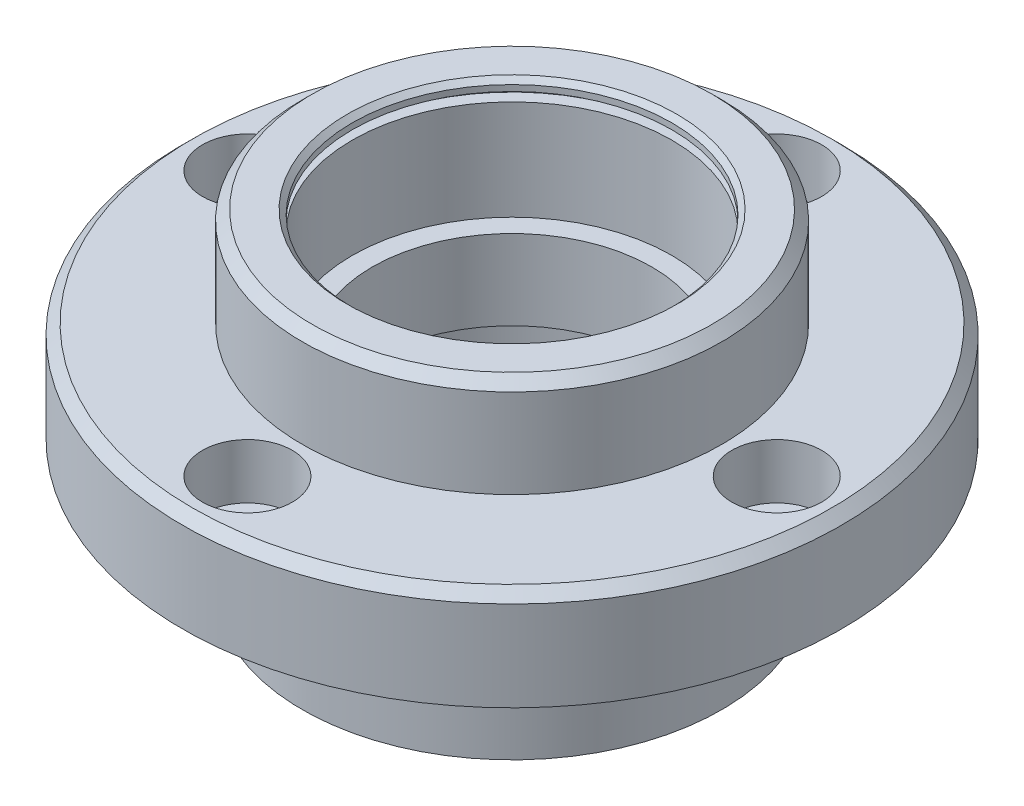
ISO-10303-21;
HEADER;
FILE_DESCRIPTION(('STEP AP214'),'2;1');
FILE_NAME('part.step','',(''),(''),'','','');
FILE_SCHEMA(('AUTOMOTIVE_DESIGN { 1 0 10303 214 1 1 1 1 }'));
ENDSEC;
DATA;
#1=APPLICATION_CONTEXT('core data for automotive mechanical design processes');
#2=APPLICATION_PROTOCOL_DEFINITION('international standard','automotive_design',2000,#1);
#3=PRODUCT_CONTEXT('',#1,'mechanical');
#4=PRODUCT('Part','Part','',(#3));
#5=PRODUCT_RELATED_PRODUCT_CATEGORY('part','',(#4));
#6=PRODUCT_DEFINITION_FORMATION('','',#4);
#7=PRODUCT_DEFINITION_CONTEXT('part definition',#1,'design');
#8=PRODUCT_DEFINITION('design','',#6,#7);
#9=PRODUCT_DEFINITION_SHAPE('','',#8);
#10=(LENGTH_UNIT() NAMED_UNIT(*) SI_UNIT(.MILLI.,.METRE.));
#11=(NAMED_UNIT(*) PLANE_ANGLE_UNIT() SI_UNIT($,.RADIAN.));
#12=(NAMED_UNIT(*) SI_UNIT($,.STERADIAN.) SOLID_ANGLE_UNIT());
#13=UNCERTAINTY_MEASURE_WITH_UNIT(LENGTH_MEASURE(1.E-05),#10,'distance_accuracy_value','');
#14=(GEOMETRIC_REPRESENTATION_CONTEXT(3) GLOBAL_UNCERTAINTY_ASSIGNED_CONTEXT((#13)) GLOBAL_UNIT_ASSIGNED_CONTEXT((#10,
#11,#12)) REPRESENTATION_CONTEXT('',''));
#15=CARTESIAN_POINT('',(0.,0.,0.));
#16=DIRECTION('',(0.,0.,1.));
#17=DIRECTION('',(1.,0.,0.));
#18=AXIS2_PLACEMENT_3D('',#15,#16,#17);
#19=CARTESIAN_POINT('',(-33.,13.,0.));
#20=DIRECTION('',(0.,1.,0.));
#21=DIRECTION('',(0.,0.,1.));
#22=AXIS2_PLACEMENT_3D('',#19,#20,#21);
#23=PLANE('',#22);
#24=CARTESIAN_POINT('',(-2.74327452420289E-13,13.,26.5));
#25=DIRECTION('',(0.,1.,0.));
#26=DIRECTION('',(0.,0.,1.));
#27=AXIS2_PLACEMENT_3D('',#24,#25,#26);
#28=CIRCLE('',#27,2.75);
#29=CARTESIAN_POINT('',(-2.74327452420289E-13,13.,29.25));
#30=VERTEX_POINT('',#29);
#31=EDGE_CURVE('E64',#30,#30,#28,.T.);
#32=ORIENTED_EDGE('',*,*,#31,.T.);
#33=EDGE_LOOP('',(#32));
#34=FACE_BOUND('',#33,.T.);
#35=CARTESIAN_POINT('',(26.5,13.,0.));
#36=DIRECTION('',(0.,1.,0.));
#37=DIRECTION('',(0.,0.,1.));
#38=AXIS2_PLACEMENT_3D('',#35,#36,#37);
#39=CIRCLE('',#38,2.75);
#40=CARTESIAN_POINT('',(26.5,13.,2.74999999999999));
#41=VERTEX_POINT('',#40);
#42=EDGE_CURVE('E69',#41,#41,#39,.T.);
#43=ORIENTED_EDGE('',*,*,#42,.T.);
#44=EDGE_LOOP('',(#43));
#45=FACE_BOUND('',#44,.T.);
#46=CARTESIAN_POINT('',(0.,13.,-26.5));
#47=DIRECTION('',(0.,1.,0.));
#48=DIRECTION('',(0.,0.,1.));
#49=AXIS2_PLACEMENT_3D('',#46,#47,#48);
#50=CIRCLE('',#49,2.75);
#51=CARTESIAN_POINT('',(0.,13.,-23.75));
#52=VERTEX_POINT('',#51);
#53=EDGE_CURVE('E74',#52,#52,#50,.T.);
#54=ORIENTED_EDGE('',*,*,#53,.T.);
#55=EDGE_LOOP('',(#54));
#56=FACE_BOUND('',#55,.T.);
#57=CARTESIAN_POINT('',(-26.5,13.,0.));
#58=DIRECTION('',(0.,1.,0.));
#59=DIRECTION('',(0.,0.,1.));
#60=AXIS2_PLACEMENT_3D('',#57,#58,#59);
#61=CIRCLE('',#60,2.75);
#62=CARTESIAN_POINT('',(-26.5,13.,2.75));
#63=VERTEX_POINT('',#62);
#64=EDGE_CURVE('E79',#63,#63,#61,.T.);
#65=ORIENTED_EDGE('',*,*,#64,.T.);
#66=EDGE_LOOP('',(#65));
#67=FACE_BOUND('',#66,.T.);
#68=CARTESIAN_POINT('',(0.,13.,0.));
#69=DIRECTION('',(0.,-1.,0.));
#70=DIRECTION('',(0.,0.,-1.));
#71=AXIS2_PLACEMENT_3D('',#68,#69,#70);
#72=CIRCLE('',#71,21.);
#73=CARTESIAN_POINT('',(0.,13.,-21.));
#74=VERTEX_POINT('',#73);
#75=EDGE_CURVE('E82',#74,#74,#72,.T.);
#76=ORIENTED_EDGE('',*,*,#75,.F.);
#77=EDGE_LOOP('',(#76));
#78=FACE_BOUND('',#77,.T.);
#79=CARTESIAN_POINT('',(0.,13.,0.));
#80=DIRECTION('',(0.,-1.,0.));
#81=DIRECTION('',(0.,0.,-1.));
#82=AXIS2_PLACEMENT_3D('',#79,#80,#81);
#83=CIRCLE('',#82,33.);
#84=CARTESIAN_POINT('',(0.,13.,-33.));
#85=VERTEX_POINT('',#84);
#86=EDGE_CURVE('E63',#85,#85,#83,.T.);
#87=ORIENTED_EDGE('',*,*,#86,.T.);
#88=EDGE_LOOP('',(#87));
#89=FACE_BOUND('',#88,.T.);
#90=ADVANCED_FACE('F31',(#34,#45,#56,#67,#78,#89),#23,.F.);
#91=CARTESIAN_POINT('',(0.,0.,0.));
#92=DIRECTION('',(0.,-1.,0.));
#93=DIRECTION('',(0.,0.,-1.));
#94=AXIS2_PLACEMENT_3D('',#91,#92,#93);
#95=CYLINDRICAL_SURFACE('',#94,33.);
#96=CARTESIAN_POINT('',(0.,22.,0.));
#97=DIRECTION('',(0.,-1.,0.));
#98=DIRECTION('',(0.,0.,-1.));
#99=AXIS2_PLACEMENT_3D('',#96,#97,#98);
#100=CIRCLE('',#99,33.);
#101=CARTESIAN_POINT('',(0.,22.,-33.));
#102=VERTEX_POINT('',#101);
#103=EDGE_CURVE('E54',#102,#102,#100,.T.);
#104=ORIENTED_EDGE('',*,*,#103,.T.);
#105=EDGE_LOOP('',(#104));
#106=FACE_BOUND('',#105,.T.);
#107=ORIENTED_EDGE('',*,*,#86,.F.);
#108=EDGE_LOOP('',(#107));
#109=FACE_BOUND('',#108,.T.);
#110=ADVANCED_FACE('F166',(#106,#109),#95,.T.);
#111=CARTESIAN_POINT('',(-21.,23.,0.));
#112=DIRECTION('',(0.,-1.,0.));
#113=DIRECTION('',(0.,0.,-1.));
#114=AXIS2_PLACEMENT_3D('',#111,#112,#113);
#115=PLANE('',#114);
#116=CARTESIAN_POINT('',(0.,23.,0.));
#117=DIRECTION('',(0.,-1.,0.));
#118=DIRECTION('',(0.,0.,-1.));
#119=AXIS2_PLACEMENT_3D('',#116,#117,#118);
#120=CIRCLE('',#119,32.);
#121=CARTESIAN_POINT('',(0.,23.,-32.));
#122=VERTEX_POINT('',#121);
#123=EDGE_CURVE('E51',#122,#122,#120,.F.);
#124=ORIENTED_EDGE('',*,*,#123,.T.);
#125=EDGE_LOOP('',(#124));
#126=FACE_BOUND('',#125,.T.);
#127=CARTESIAN_POINT('',(-2.74327452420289E-13,23.,26.5));
#128=DIRECTION('',(0.,1.,0.));
#129=DIRECTION('',(0.,0.,1.));
#130=AXIS2_PLACEMENT_3D('',#127,#128,#129);
#131=CIRCLE('',#130,4.5);
#132=CARTESIAN_POINT('',(-2.74327452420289E-13,23.,31.));
#133=VERTEX_POINT('',#132);
#134=EDGE_CURVE('E156',#133,#133,#131,.T.);
#135=ORIENTED_EDGE('',*,*,#134,.F.);
#136=EDGE_LOOP('',(#135));
#137=FACE_BOUND('',#136,.T.);
#138=CARTESIAN_POINT('',(26.5,23.,0.));
#139=DIRECTION('',(0.,1.,0.));
#140=DIRECTION('',(0.,0.,1.));
#141=AXIS2_PLACEMENT_3D('',#138,#139,#140);
#142=CIRCLE('',#141,4.5);
#143=CARTESIAN_POINT('',(26.5,23.,4.5));
#144=VERTEX_POINT('',#143);
#145=EDGE_CURVE('E67',#144,#144,#142,.T.);
#146=ORIENTED_EDGE('',*,*,#145,.F.);
#147=EDGE_LOOP('',(#146));
#148=FACE_BOUND('',#147,.T.);
#149=CARTESIAN_POINT('',(0.,23.,-26.5));
#150=DIRECTION('',(0.,1.,0.));
#151=DIRECTION('',(0.,0.,1.));
#152=AXIS2_PLACEMENT_3D('',#149,#150,#151);
#153=CIRCLE('',#152,4.5);
#154=CARTESIAN_POINT('',(0.,23.,-22.));
#155=VERTEX_POINT('',#154);
#156=EDGE_CURVE('E72',#155,#155,#153,.T.);
#157=ORIENTED_EDGE('',*,*,#156,.F.);
#158=EDGE_LOOP('',(#157));
#159=FACE_BOUND('',#158,.T.);
#160=CARTESIAN_POINT('',(-26.5,23.,0.));
#161=DIRECTION('',(0.,1.,0.));
#162=DIRECTION('',(0.,0.,1.));
#163=AXIS2_PLACEMENT_3D('',#160,#161,#162);
#164=CIRCLE('',#163,4.5);
#165=CARTESIAN_POINT('',(-26.5,23.,4.5));
#166=VERTEX_POINT('',#165);
#167=EDGE_CURVE('E77',#166,#166,#164,.T.);
#168=ORIENTED_EDGE('',*,*,#167,.F.);
#169=EDGE_LOOP('',(#168));
#170=FACE_BOUND('',#169,.T.);
#171=CARTESIAN_POINT('',(0.,23.,0.));
#172=DIRECTION('',(0.,-1.,0.));
#173=DIRECTION('',(0.,0.,-1.));
#174=AXIS2_PLACEMENT_3D('',#171,#172,#173);
#175=CIRCLE('',#174,21.);
#176=CARTESIAN_POINT('',(0.,23.,-21.));
#177=VERTEX_POINT('',#176);
#178=EDGE_CURVE('E86',#177,#177,#175,.T.);
#179=ORIENTED_EDGE('',*,*,#178,.T.);
#180=EDGE_LOOP('',(#179));
#181=FACE_BOUND('',#180,.T.);
#182=ADVANCED_FACE('F162',(#126,#137,#148,#159,#170,#181),#115,.F.);
#183=CARTESIAN_POINT('',(0.,0.,0.));
#184=DIRECTION('',(0.,-1.,0.));
#185=DIRECTION('',(0.,0.,-1.));
#186=AXIS2_PLACEMENT_3D('',#183,#184,#185);
#187=CYLINDRICAL_SURFACE('',#186,21.);
#188=CARTESIAN_POINT('',(0.,31.9,0.));
#189=DIRECTION('',(0.,-1.,0.));
#190=DIRECTION('',(0.,0.,-1.));
#191=AXIS2_PLACEMENT_3D('',#188,#189,#190);
#192=CIRCLE('',#191,21.);
#193=CARTESIAN_POINT('',(0.,31.9,-21.));
#194=VERTEX_POINT('',#193);
#195=EDGE_CURVE('E60',#194,#194,#192,.T.);
#196=ORIENTED_EDGE('',*,*,#195,.T.);
#197=EDGE_LOOP('',(#196));
#198=FACE_BOUND('',#197,.T.);
#199=ORIENTED_EDGE('',*,*,#178,.F.);
#200=EDGE_LOOP('',(#199));
#201=FACE_BOUND('',#200,.T.);
#202=ADVANCED_FACE('F165',(#198,#201),#187,.T.);
#203=CARTESIAN_POINT('',(-16.,32.9,0.));
#204=DIRECTION('',(0.,-1.,0.));
#205=DIRECTION('',(0.,0.,-1.));
#206=AXIS2_PLACEMENT_3D('',#203,#204,#205);
#207=PLANE('',#206);
#208=CARTESIAN_POINT('',(0.,32.9,0.));
#209=DIRECTION('',(0.,-1.,0.));
#210=DIRECTION('',(0.,0.,-1.));
#211=AXIS2_PLACEMENT_3D('',#208,#209,#210);
#212=CIRCLE('',#211,16.5);
#213=CARTESIAN_POINT('',(0.,32.9,-16.5));
#214=VERTEX_POINT('',#213);
#215=EDGE_CURVE('E38',#214,#214,#212,.T.);
#216=ORIENTED_EDGE('',*,*,#215,.T.);
#217=EDGE_LOOP('',(#216));
#218=FACE_BOUND('',#217,.T.);
#219=CARTESIAN_POINT('',(0.,32.9,0.));
#220=DIRECTION('',(0.,-1.,0.));
#221=DIRECTION('',(0.,0.,-1.));
#222=AXIS2_PLACEMENT_3D('',#219,#220,#221);
#223=CIRCLE('',#222,20.);
#224=CARTESIAN_POINT('',(0.,32.9,-20.));
#225=VERTEX_POINT('',#224);
#226=EDGE_CURVE('E57',#225,#225,#223,.F.);
#227=ORIENTED_EDGE('',*,*,#226,.T.);
#228=EDGE_LOOP('',(#227));
#229=FACE_BOUND('',#228,.T.);
#230=ADVANCED_FACE('F178',(#218,#229),#207,.F.);
#231=CARTESIAN_POINT('',(0.,0.,0.));
#232=DIRECTION('',(0.,-1.,0.));
#233=DIRECTION('',(0.,0.,-1.));
#234=AXIS2_PLACEMENT_3D('',#231,#232,#233);
#235=CYLINDRICAL_SURFACE('',#234,16.);
#236=CARTESIAN_POINT('',(0.,32.4,0.));
#237=DIRECTION('',(0.,-1.,0.));
#238=DIRECTION('',(0.,0.,-1.));
#239=AXIS2_PLACEMENT_3D('',#236,#237,#238);
#240=CIRCLE('',#239,16.);
#241=CARTESIAN_POINT('',(0.,32.4,-16.));
#242=VERTEX_POINT('',#241);
#243=EDGE_CURVE('E10',#242,#242,#240,.F.);
#244=ORIENTED_EDGE('',*,*,#243,.T.);
#245=EDGE_LOOP('',(#244));
#246=FACE_BOUND('',#245,.T.);
#247=CARTESIAN_POINT('',(0.,31.8,0.));
#248=DIRECTION('',(0.,-1.,0.));
#249=DIRECTION('',(0.,0.,-1.));
#250=AXIS2_PLACEMENT_3D('',#247,#248,#249);
#251=CIRCLE('',#250,16.);
#252=CARTESIAN_POINT('',(0.,31.8,-16.));
#253=VERTEX_POINT('',#252);
#254=EDGE_CURVE('E89',#253,#253,#251,.T.);
#255=ORIENTED_EDGE('',*,*,#254,.T.);
#256=EDGE_LOOP('',(#255));
#257=FACE_BOUND('',#256,.T.);
#258=ADVANCED_FACE('F184',(#246,#257),#235,.F.);
#259=CARTESIAN_POINT('',(-17.2,31.8,0.));
#260=DIRECTION('',(0.,1.,0.));
#261=DIRECTION('',(0.,0.,1.));
#262=AXIS2_PLACEMENT_3D('',#259,#260,#261);
#263=PLANE('',#262);
#264=ORIENTED_EDGE('',*,*,#254,.F.);
#265=EDGE_LOOP('',(#264));
#266=FACE_BOUND('',#265,.T.);
#267=CARTESIAN_POINT('',(0.,31.8,0.));
#268=DIRECTION('',(0.,-1.,0.));
#269=DIRECTION('',(0.,0.,-1.));
#270=AXIS2_PLACEMENT_3D('',#267,#268,#269);
#271=CIRCLE('',#270,17.2);
#272=CARTESIAN_POINT('',(0.,31.8,-17.2));
#273=VERTEX_POINT('',#272);
#274=EDGE_CURVE('E92',#273,#273,#271,.T.);
#275=ORIENTED_EDGE('',*,*,#274,.T.);
#276=EDGE_LOOP('',(#275));
#277=FACE_BOUND('',#276,.T.);
#278=ADVANCED_FACE('F265',(#266,#277),#263,.F.);
#279=CARTESIAN_POINT('',(0.,0.,0.));
#280=DIRECTION('',(0.,-1.,0.));
#281=DIRECTION('',(0.,0.,-1.));
#282=AXIS2_PLACEMENT_3D('',#279,#280,#281);
#283=CYLINDRICAL_SURFACE('',#282,17.2);
#284=ORIENTED_EDGE('',*,*,#274,.F.);
#285=EDGE_LOOP('',(#284));
#286=FACE_BOUND('',#285,.T.);
#287=CARTESIAN_POINT('',(0.,30.9,0.));
#288=DIRECTION('',(0.,-1.,0.));
#289=DIRECTION('',(0.,0.,-1.));
#290=AXIS2_PLACEMENT_3D('',#287,#288,#289);
#291=CIRCLE('',#290,17.2);
#292=CARTESIAN_POINT('',(0.,30.9,-17.2));
#293=VERTEX_POINT('',#292);
#294=EDGE_CURVE('E95',#293,#293,#291,.T.);
#295=ORIENTED_EDGE('',*,*,#294,.T.);
#296=EDGE_LOOP('',(#295));
#297=FACE_BOUND('',#296,.T.);
#298=ADVANCED_FACE('F261',(#286,#297),#283,.F.);
#299=CARTESIAN_POINT('',(-16.,30.9,0.));
#300=DIRECTION('',(0.,-1.,0.));
#301=DIRECTION('',(0.,0.,-1.));
#302=AXIS2_PLACEMENT_3D('',#299,#300,#301);
#303=PLANE('',#302);
#304=ORIENTED_EDGE('',*,*,#294,.F.);
#305=EDGE_LOOP('',(#304));
#306=FACE_BOUND('',#305,.T.);
#307=CARTESIAN_POINT('',(0.,30.9,0.));
#308=DIRECTION('',(0.,-1.,0.));
#309=DIRECTION('',(0.,0.,-1.));
#310=AXIS2_PLACEMENT_3D('',#307,#308,#309);
#311=CIRCLE('',#310,16.);
#312=CARTESIAN_POINT('',(0.,30.9,-16.));
#313=VERTEX_POINT('',#312);
#314=EDGE_CURVE('E98',#313,#313,#311,.T.);
#315=ORIENTED_EDGE('',*,*,#314,.T.);
#316=EDGE_LOOP('',(#315));
#317=FACE_BOUND('',#316,.T.);
#318=ADVANCED_FACE('F257',(#306,#317),#303,.F.);
#319=CARTESIAN_POINT('',(0.,0.,0.));
#320=DIRECTION('',(0.,-1.,0.));
#321=DIRECTION('',(0.,0.,-1.));
#322=AXIS2_PLACEMENT_3D('',#319,#320,#321);
#323=CYLINDRICAL_SURFACE('',#322,16.);
#324=ORIENTED_EDGE('',*,*,#314,.F.);
#325=EDGE_LOOP('',(#324));
#326=FACE_BOUND('',#325,.T.);
#327=CARTESIAN_POINT('',(0.,20.9,0.));
#328=DIRECTION('',(0.,-1.,0.));
#329=DIRECTION('',(0.,0.,-1.));
#330=AXIS2_PLACEMENT_3D('',#327,#328,#329);
#331=CIRCLE('',#330,16.);
#332=CARTESIAN_POINT('',(0.,20.9,-16.));
#333=VERTEX_POINT('',#332);
#334=EDGE_CURVE('E101',#333,#333,#331,.T.);
#335=ORIENTED_EDGE('',*,*,#334,.T.);
#336=EDGE_LOOP('',(#335));
#337=FACE_BOUND('',#336,.T.);
#338=ADVANCED_FACE('F253',(#326,#337),#323,.F.);
#339=CARTESIAN_POINT('',(-14.,20.9,0.));
#340=DIRECTION('',(0.,-1.,0.));
#341=DIRECTION('',(0.,0.,-1.));
#342=AXIS2_PLACEMENT_3D('',#339,#340,#341);
#343=PLANE('',#342);
#344=ORIENTED_EDGE('',*,*,#334,.F.);
#345=EDGE_LOOP('',(#344));
#346=FACE_BOUND('',#345,.T.);
#347=CARTESIAN_POINT('',(0.,20.9,0.));
#348=DIRECTION('',(0.,-1.,0.));
#349=DIRECTION('',(0.,0.,-1.));
#350=AXIS2_PLACEMENT_3D('',#347,#348,#349);
#351=CIRCLE('',#350,14.);
#352=CARTESIAN_POINT('',(0.,20.9,-14.));
#353=VERTEX_POINT('',#352);
#354=EDGE_CURVE('E104',#353,#353,#351,.T.);
#355=ORIENTED_EDGE('',*,*,#354,.T.);
#356=EDGE_LOOP('',(#355));
#357=FACE_BOUND('',#356,.T.);
#358=ADVANCED_FACE('F249',(#346,#357),#343,.F.);
#359=CARTESIAN_POINT('',(0.,0.,0.));
#360=DIRECTION('',(0.,-1.,0.));
#361=DIRECTION('',(0.,0.,-1.));
#362=AXIS2_PLACEMENT_3D('',#359,#360,#361);
#363=CYLINDRICAL_SURFACE('',#362,14.);
#364=ORIENTED_EDGE('',*,*,#354,.F.);
#365=EDGE_LOOP('',(#364));
#366=FACE_BOUND('',#365,.T.);
#367=CARTESIAN_POINT('',(0.,12.9,0.));
#368=DIRECTION('',(0.,-1.,0.));
#369=DIRECTION('',(0.,0.,-1.));
#370=AXIS2_PLACEMENT_3D('',#367,#368,#369);
#371=CIRCLE('',#370,14.);
#372=CARTESIAN_POINT('',(0.,12.9,-14.));
#373=VERTEX_POINT('',#372);
#374=EDGE_CURVE('E107',#373,#373,#371,.T.);
#375=ORIENTED_EDGE('',*,*,#374,.T.);
#376=EDGE_LOOP('',(#375));
#377=FACE_BOUND('',#376,.T.);
#378=ADVANCED_FACE('F245',(#366,#377),#363,.F.);
#379=CARTESIAN_POINT('',(-16.,12.9,0.));
#380=DIRECTION('',(0.,1.,0.));
#381=DIRECTION('',(0.,0.,1.));
#382=AXIS2_PLACEMENT_3D('',#379,#380,#381);
#383=PLANE('',#382);
#384=ORIENTED_EDGE('',*,*,#374,.F.);
#385=EDGE_LOOP('',(#384));
#386=FACE_BOUND('',#385,.T.);
#387=CARTESIAN_POINT('',(0.,12.9,0.));
#388=DIRECTION('',(0.,-1.,0.));
#389=DIRECTION('',(0.,0.,-1.));
#390=AXIS2_PLACEMENT_3D('',#387,#388,#389);
#391=CIRCLE('',#390,16.);
#392=CARTESIAN_POINT('',(0.,12.9,-16.));
#393=VERTEX_POINT('',#392);
#394=EDGE_CURVE('E110',#393,#393,#391,.T.);
#395=ORIENTED_EDGE('',*,*,#394,.T.);
#396=EDGE_LOOP('',(#395));
#397=FACE_BOUND('',#396,.T.);
#398=ADVANCED_FACE('F241',(#386,#397),#383,.F.);
#399=CARTESIAN_POINT('',(0.,0.,0.));
#400=DIRECTION('',(0.,-1.,0.));
#401=DIRECTION('',(0.,0.,-1.));
#402=AXIS2_PLACEMENT_3D('',#399,#400,#401);
#403=CYLINDRICAL_SURFACE('',#402,16.);
#404=ORIENTED_EDGE('',*,*,#394,.F.);
#405=EDGE_LOOP('',(#404));
#406=FACE_BOUND('',#405,.T.);
#407=CARTESIAN_POINT('',(0.,2.9,0.));
#408=DIRECTION('',(0.,-1.,0.));
#409=DIRECTION('',(0.,0.,-1.));
#410=AXIS2_PLACEMENT_3D('',#407,#408,#409);
#411=CIRCLE('',#410,16.);
#412=CARTESIAN_POINT('',(0.,2.9,-16.));
#413=VERTEX_POINT('',#412);
#414=EDGE_CURVE('E113',#413,#413,#411,.T.);
#415=ORIENTED_EDGE('',*,*,#414,.T.);
#416=EDGE_LOOP('',(#415));
#417=FACE_BOUND('',#416,.T.);
#418=ADVANCED_FACE('F237',(#406,#417),#403,.F.);
#419=CARTESIAN_POINT('',(-17.2,2.9,0.));
#420=DIRECTION('',(0.,1.,0.));
#421=DIRECTION('',(0.,0.,1.));
#422=AXIS2_PLACEMENT_3D('',#419,#420,#421);
#423=PLANE('',#422);
#424=ORIENTED_EDGE('',*,*,#414,.F.);
#425=EDGE_LOOP('',(#424));
#426=FACE_BOUND('',#425,.T.);
#427=CARTESIAN_POINT('',(0.,2.9,0.));
#428=DIRECTION('',(0.,-1.,0.));
#429=DIRECTION('',(0.,0.,-1.));
#430=AXIS2_PLACEMENT_3D('',#427,#428,#429);
#431=CIRCLE('',#430,17.2);
#432=CARTESIAN_POINT('',(0.,2.9,-17.2));
#433=VERTEX_POINT('',#432);
#434=EDGE_CURVE('E116',#433,#433,#431,.T.);
#435=ORIENTED_EDGE('',*,*,#434,.T.);
#436=EDGE_LOOP('',(#435));
#437=FACE_BOUND('',#436,.T.);
#438=ADVANCED_FACE('F229',(#426,#437),#423,.F.);
#439=CARTESIAN_POINT('',(0.,0.,0.));
#440=DIRECTION('',(0.,-1.,0.));
#441=DIRECTION('',(0.,0.,-1.));
#442=AXIS2_PLACEMENT_3D('',#439,#440,#441);
#443=CYLINDRICAL_SURFACE('',#442,17.2);
#444=ORIENTED_EDGE('',*,*,#434,.F.);
#445=EDGE_LOOP('',(#444));
#446=FACE_BOUND('',#445,.T.);
#447=CARTESIAN_POINT('',(0.,2.,0.));
#448=DIRECTION('',(0.,-1.,0.));
#449=DIRECTION('',(0.,0.,-1.));
#450=AXIS2_PLACEMENT_3D('',#447,#448,#449);
#451=CIRCLE('',#450,17.2);
#452=CARTESIAN_POINT('',(0.,2.,-17.2));
#453=VERTEX_POINT('',#452);
#454=EDGE_CURVE('E119',#453,#453,#451,.T.);
#455=ORIENTED_EDGE('',*,*,#454,.T.);
#456=EDGE_LOOP('',(#455));
#457=FACE_BOUND('',#456,.T.);
#458=ADVANCED_FACE('F223',(#446,#457),#443,.F.);
#459=CARTESIAN_POINT('',(-16.,2.,0.));
#460=DIRECTION('',(0.,-1.,0.));
#461=DIRECTION('',(0.,0.,-1.));
#462=AXIS2_PLACEMENT_3D('',#459,#460,#461);
#463=PLANE('',#462);
#464=ORIENTED_EDGE('',*,*,#454,.F.);
#465=EDGE_LOOP('',(#464));
#466=FACE_BOUND('',#465,.T.);
#467=CARTESIAN_POINT('',(0.,2.,0.));
#468=DIRECTION('',(0.,-1.,0.));
#469=DIRECTION('',(0.,0.,-1.));
#470=AXIS2_PLACEMENT_3D('',#467,#468,#469);
#471=CIRCLE('',#470,16.);
#472=CARTESIAN_POINT('',(0.,2.,-16.));
#473=VERTEX_POINT('',#472);
#474=EDGE_CURVE('E122',#473,#473,#471,.T.);
#475=ORIENTED_EDGE('',*,*,#474,.T.);
#476=EDGE_LOOP('',(#475));
#477=FACE_BOUND('',#476,.T.);
#478=ADVANCED_FACE('F218',(#466,#477),#463,.F.);
#479=CARTESIAN_POINT('',(0.,0.,0.));
#480=DIRECTION('',(0.,-1.,0.));
#481=DIRECTION('',(0.,0.,-1.));
#482=AXIS2_PLACEMENT_3D('',#479,#480,#481);
#483=CYLINDRICAL_SURFACE('',#482,16.);
#484=CARTESIAN_POINT('',(0.,0.5,0.));
#485=DIRECTION('',(0.,1.,0.));
#486=DIRECTION('',(0.,0.,1.));
#487=AXIS2_PLACEMENT_3D('',#484,#485,#486);
#488=CIRCLE('',#487,16.);
#489=CARTESIAN_POINT('',(0.,0.5,16.));
#490=VERTEX_POINT('',#489);
#491=EDGE_CURVE('E46',#490,#490,#488,.F.);
#492=ORIENTED_EDGE('',*,*,#491,.T.);
#493=EDGE_LOOP('',(#492));
#494=FACE_BOUND('',#493,.T.);
#495=ORIENTED_EDGE('',*,*,#474,.F.);
#496=EDGE_LOOP('',(#495));
#497=FACE_BOUND('',#496,.T.);
#498=ADVANCED_FACE('F214',(#494,#497),#483,.F.);
#499=CARTESIAN_POINT('',(-21.,0.,0.));
#500=DIRECTION('',(0.,1.,0.));
#501=DIRECTION('',(0.,0.,1.));
#502=AXIS2_PLACEMENT_3D('',#499,#500,#501);
#503=PLANE('',#502);
#504=CARTESIAN_POINT('',(0.,0.,0.));
#505=DIRECTION('',(0.,1.,0.));
#506=DIRECTION('',(0.,0.,1.));
#507=AXIS2_PLACEMENT_3D('',#504,#505,#506);
#508=CIRCLE('',#507,16.5);
#509=CARTESIAN_POINT('',(0.,0.,16.5));
#510=VERTEX_POINT('',#509);
#511=EDGE_CURVE('E42',#510,#510,#508,.T.);
#512=ORIENTED_EDGE('',*,*,#511,.T.);
#513=EDGE_LOOP('',(#512));
#514=FACE_BOUND('',#513,.T.);
#515=CARTESIAN_POINT('',(0.,0.,0.));
#516=DIRECTION('',(0.,-1.,0.));
#517=DIRECTION('',(0.,0.,-1.));
#518=AXIS2_PLACEMENT_3D('',#515,#516,#517);
#519=CIRCLE('',#518,21.);
#520=CARTESIAN_POINT('',(0.,0.,-21.));
#521=VERTEX_POINT('',#520);
#522=EDGE_CURVE('E125',#521,#521,#519,.T.);
#523=ORIENTED_EDGE('',*,*,#522,.T.);
#524=EDGE_LOOP('',(#523));
#525=FACE_BOUND('',#524,.T.);
#526=ADVANCED_FACE('F217',(#514,#525),#503,.F.);
#527=CARTESIAN_POINT('',(0.,0.,0.));
#528=DIRECTION('',(0.,-1.,0.));
#529=DIRECTION('',(0.,0.,-1.));
#530=AXIS2_PLACEMENT_3D('',#527,#528,#529);
#531=CYLINDRICAL_SURFACE('',#530,21.);
#532=ORIENTED_EDGE('',*,*,#522,.F.);
#533=EDGE_LOOP('',(#532));
#534=FACE_BOUND('',#533,.T.);
#535=ORIENTED_EDGE('',*,*,#75,.T.);
#536=EDGE_LOOP('',(#535));
#537=FACE_BOUND('',#536,.T.);
#538=ADVANCED_FACE('F347',(#534,#537),#531,.T.);
#539=CARTESIAN_POINT('',(-26.5,23.,0.));
#540=DIRECTION('',(0.,1.,0.));
#541=DIRECTION('',(0.,0.,1.));
#542=AXIS2_PLACEMENT_3D('',#539,#540,#541);
#543=CYLINDRICAL_SURFACE('',#542,2.75);
#544=CARTESIAN_POINT('',(-26.5,17.5,0.));
#545=DIRECTION('',(0.,1.,0.));
#546=DIRECTION('',(0.,0.,1.));
#547=AXIS2_PLACEMENT_3D('',#544,#545,#546);
#548=CIRCLE('',#547,2.75);
#549=CARTESIAN_POINT('',(-26.5,17.5,2.75));
#550=VERTEX_POINT('',#549);
#551=EDGE_CURVE('E83',#550,#550,#548,.T.);
#552=ORIENTED_EDGE('',*,*,#551,.T.);
#553=EDGE_LOOP('',(#552));
#554=FACE_BOUND('',#553,.T.);
#555=ORIENTED_EDGE('',*,*,#64,.F.);
#556=EDGE_LOOP('',(#555));
#557=FACE_BOUND('',#556,.T.);
#558=ADVANCED_FACE('F352',(#554,#557),#543,.F.);
#559=CARTESIAN_POINT('',(-23.75,17.5,0.));
#560=DIRECTION('',(0.,-1.,0.));
#561=DIRECTION('',(0.,0.,-1.));
#562=AXIS2_PLACEMENT_3D('',#559,#560,#561);
#563=PLANE('',#562);
#564=ORIENTED_EDGE('',*,*,#551,.F.);
#565=EDGE_LOOP('',(#564));
#566=FACE_BOUND('',#565,.T.);
#567=CARTESIAN_POINT('',(-26.5,17.5,0.));
#568=DIRECTION('',(0.,1.,0.));
#569=DIRECTION('',(0.,0.,1.));
#570=AXIS2_PLACEMENT_3D('',#567,#568,#569);
#571=CIRCLE('',#570,4.5);
#572=CARTESIAN_POINT('',(-26.5,17.5,4.5));
#573=VERTEX_POINT('',#572);
#574=EDGE_CURVE('E132',#573,#573,#571,.T.);
#575=ORIENTED_EDGE('',*,*,#574,.T.);
#576=EDGE_LOOP('',(#575));
#577=FACE_BOUND('',#576,.T.);
#578=ADVANCED_FACE('F364',(#566,#577),#563,.F.);
#579=CARTESIAN_POINT('',(-26.5,23.,0.));
#580=DIRECTION('',(0.,1.,0.));
#581=DIRECTION('',(0.,0.,1.));
#582=AXIS2_PLACEMENT_3D('',#579,#580,#581);
#583=CYLINDRICAL_SURFACE('',#582,4.5);
#584=ORIENTED_EDGE('',*,*,#574,.F.);
#585=EDGE_LOOP('',(#584));
#586=FACE_BOUND('',#585,.T.);
#587=ORIENTED_EDGE('',*,*,#167,.T.);
#588=EDGE_LOOP('',(#587));
#589=FACE_BOUND('',#588,.T.);
#590=ADVANCED_FACE('F374',(#586,#589),#583,.F.);
#591=CARTESIAN_POINT('',(0.,23.,-26.5));
#592=DIRECTION('',(0.,1.,0.));
#593=DIRECTION('',(0.,0.,1.));
#594=AXIS2_PLACEMENT_3D('',#591,#592,#593);
#595=CYLINDRICAL_SURFACE('',#594,2.75);
#596=CARTESIAN_POINT('',(0.,17.5,-26.5));
#597=DIRECTION('',(0.,1.,0.));
#598=DIRECTION('',(0.,0.,1.));
#599=AXIS2_PLACEMENT_3D('',#596,#597,#598);
#600=CIRCLE('',#599,2.75);
#601=CARTESIAN_POINT('',(0.,17.5,-23.75));
#602=VERTEX_POINT('',#601);
#603=EDGE_CURVE('E78',#602,#602,#600,.T.);
#604=ORIENTED_EDGE('',*,*,#603,.T.);
#605=EDGE_LOOP('',(#604));
#606=FACE_BOUND('',#605,.T.);
#607=ORIENTED_EDGE('',*,*,#53,.F.);
#608=EDGE_LOOP('',(#607));
#609=FACE_BOUND('',#608,.T.);
#610=ADVANCED_FACE('F383',(#606,#609),#595,.F.);
#611=CARTESIAN_POINT('',(2.75000000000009,17.5,-26.5));
#612=DIRECTION('',(0.,-1.,0.));
#613=DIRECTION('',(0.,0.,-1.));
#614=AXIS2_PLACEMENT_3D('',#611,#612,#613);
#615=PLANE('',#614);
#616=ORIENTED_EDGE('',*,*,#603,.F.);
#617=EDGE_LOOP('',(#616));
#618=FACE_BOUND('',#617,.T.);
#619=CARTESIAN_POINT('',(0.,17.5,-26.5));
#620=DIRECTION('',(0.,1.,0.));
#621=DIRECTION('',(0.,0.,1.));
#622=AXIS2_PLACEMENT_3D('',#619,#620,#621);
#623=CIRCLE('',#622,4.5);
#624=CARTESIAN_POINT('',(0.,17.5,-22.));
#625=VERTEX_POINT('',#624);
#626=EDGE_CURVE('E139',#625,#625,#623,.T.);
#627=ORIENTED_EDGE('',*,*,#626,.T.);
#628=EDGE_LOOP('',(#627));
#629=FACE_BOUND('',#628,.T.);
#630=ADVANCED_FACE('F399',(#618,#629),#615,.F.);
#631=CARTESIAN_POINT('',(0.,23.,-26.5));
#632=DIRECTION('',(0.,1.,0.));
#633=DIRECTION('',(0.,0.,1.));
#634=AXIS2_PLACEMENT_3D('',#631,#632,#633);
#635=CYLINDRICAL_SURFACE('',#634,4.5);
#636=ORIENTED_EDGE('',*,*,#626,.F.);
#637=EDGE_LOOP('',(#636));
#638=FACE_BOUND('',#637,.T.);
#639=ORIENTED_EDGE('',*,*,#156,.T.);
#640=EDGE_LOOP('',(#639));
#641=FACE_BOUND('',#640,.T.);
#642=ADVANCED_FACE('F409',(#638,#641),#635,.F.);
#643=CARTESIAN_POINT('',(26.5,23.,0.));
#644=DIRECTION('',(0.,1.,0.));
#645=DIRECTION('',(0.,0.,1.));
#646=AXIS2_PLACEMENT_3D('',#643,#644,#645);
#647=CYLINDRICAL_SURFACE('',#646,2.75);
#648=CARTESIAN_POINT('',(26.5,17.5,0.));
#649=DIRECTION('',(0.,1.,0.));
#650=DIRECTION('',(0.,0.,1.));
#651=AXIS2_PLACEMENT_3D('',#648,#649,#650);
#652=CIRCLE('',#651,2.75);
#653=CARTESIAN_POINT('',(26.5,17.5,2.75));
#654=VERTEX_POINT('',#653);
#655=EDGE_CURVE('E73',#654,#654,#652,.T.);
#656=ORIENTED_EDGE('',*,*,#655,.T.);
#657=EDGE_LOOP('',(#656));
#658=FACE_BOUND('',#657,.T.);
#659=ORIENTED_EDGE('',*,*,#42,.F.);
#660=EDGE_LOOP('',(#659));
#661=FACE_BOUND('',#660,.T.);
#662=ADVANCED_FACE('F419',(#658,#661),#647,.F.);
#663=CARTESIAN_POINT('',(29.25,17.5,0.));
#664=DIRECTION('',(0.,-1.,0.));
#665=DIRECTION('',(0.,0.,-1.));
#666=AXIS2_PLACEMENT_3D('',#663,#664,#665);
#667=PLANE('',#666);
#668=ORIENTED_EDGE('',*,*,#655,.F.);
#669=EDGE_LOOP('',(#668));
#670=FACE_BOUND('',#669,.T.);
#671=CARTESIAN_POINT('',(26.5,17.5,0.));
#672=DIRECTION('',(0.,1.,0.));
#673=DIRECTION('',(0.,0.,1.));
#674=AXIS2_PLACEMENT_3D('',#671,#672,#673);
#675=CIRCLE('',#674,4.5);
#676=CARTESIAN_POINT('',(26.5,17.5,4.5));
#677=VERTEX_POINT('',#676);
#678=EDGE_CURVE('E146',#677,#677,#675,.T.);
#679=ORIENTED_EDGE('',*,*,#678,.T.);
#680=EDGE_LOOP('',(#679));
#681=FACE_BOUND('',#680,.T.);
#682=ADVANCED_FACE('F429',(#670,#681),#667,.F.);
#683=CARTESIAN_POINT('',(26.5,23.,0.));
#684=DIRECTION('',(0.,1.,0.));
#685=DIRECTION('',(0.,0.,1.));
#686=AXIS2_PLACEMENT_3D('',#683,#684,#685);
#687=CYLINDRICAL_SURFACE('',#686,4.5);
#688=ORIENTED_EDGE('',*,*,#678,.F.);
#689=EDGE_LOOP('',(#688));
#690=FACE_BOUND('',#689,.T.);
#691=ORIENTED_EDGE('',*,*,#145,.T.);
#692=EDGE_LOOP('',(#691));
#693=FACE_BOUND('',#692,.T.);
#694=ADVANCED_FACE('F439',(#690,#693),#687,.F.);
#695=CARTESIAN_POINT('',(-2.74327452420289E-13,23.,26.5));
#696=DIRECTION('',(0.,1.,0.));
#697=DIRECTION('',(0.,0.,1.));
#698=AXIS2_PLACEMENT_3D('',#695,#696,#697);
#699=CYLINDRICAL_SURFACE('',#698,2.75);
#700=CARTESIAN_POINT('',(-2.74327452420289E-13,17.5,26.5));
#701=DIRECTION('',(0.,1.,0.));
#702=DIRECTION('',(0.,0.,1.));
#703=AXIS2_PLACEMENT_3D('',#700,#701,#702);
#704=CIRCLE('',#703,2.75);
#705=CARTESIAN_POINT('',(-2.74327452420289E-13,17.5,29.25));
#706=VERTEX_POINT('',#705);
#707=EDGE_CURVE('E68',#706,#706,#704,.T.);
#708=ORIENTED_EDGE('',*,*,#707,.T.);
#709=EDGE_LOOP('',(#708));
#710=FACE_BOUND('',#709,.T.);
#711=ORIENTED_EDGE('',*,*,#31,.F.);
#712=EDGE_LOOP('',(#711));
#713=FACE_BOUND('',#712,.T.);
#714=ADVANCED_FACE('F449',(#710,#713),#699,.F.);
#715=CARTESIAN_POINT('',(2.74999999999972,17.5,26.5));
#716=DIRECTION('',(0.,-1.,0.));
#717=DIRECTION('',(0.,0.,-1.));
#718=AXIS2_PLACEMENT_3D('',#715,#716,#717);
#719=PLANE('',#718);
#720=ORIENTED_EDGE('',*,*,#707,.F.);
#721=EDGE_LOOP('',(#720));
#722=FACE_BOUND('',#721,.T.);
#723=CARTESIAN_POINT('',(-2.74327452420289E-13,17.5,26.5));
#724=DIRECTION('',(0.,1.,0.));
#725=DIRECTION('',(0.,0.,1.));
#726=AXIS2_PLACEMENT_3D('',#723,#724,#725);
#727=CIRCLE('',#726,4.5);
#728=CARTESIAN_POINT('',(-2.74327452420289E-13,17.5,31.));
#729=VERTEX_POINT('',#728);
#730=EDGE_CURVE('E153',#729,#729,#727,.T.);
#731=ORIENTED_EDGE('',*,*,#730,.T.);
#732=EDGE_LOOP('',(#731));
#733=FACE_BOUND('',#732,.T.);
#734=ADVANCED_FACE('F459',(#722,#733),#719,.F.);
#735=CARTESIAN_POINT('',(-2.74327452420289E-13,23.,26.5));
#736=DIRECTION('',(0.,1.,0.));
#737=DIRECTION('',(0.,0.,1.));
#738=AXIS2_PLACEMENT_3D('',#735,#736,#737);
#739=CYLINDRICAL_SURFACE('',#738,4.5);
#740=ORIENTED_EDGE('',*,*,#730,.F.);
#741=EDGE_LOOP('',(#740));
#742=FACE_BOUND('',#741,.T.);
#743=ORIENTED_EDGE('',*,*,#134,.T.);
#744=EDGE_LOOP('',(#743));
#745=FACE_BOUND('',#744,.T.);
#746=ADVANCED_FACE('F160',(#742,#745),#739,.F.);
#747=CARTESIAN_POINT('',(0.,31.9,0.));
#748=DIRECTION('',(0.,-1.,0.));
#749=DIRECTION('',(0.,0.,-1.));
#750=AXIS2_PLACEMENT_3D('',#747,#748,#749);
#751=CONICAL_SURFACE('',#750,21.,0.785398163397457);
#752=ORIENTED_EDGE('',*,*,#226,.F.);
#753=EDGE_LOOP('',(#752));
#754=FACE_BOUND('',#753,.T.);
#755=ORIENTED_EDGE('',*,*,#195,.F.);
#756=EDGE_LOOP('',(#755));
#757=FACE_BOUND('',#756,.T.);
#758=ADVANCED_FACE('F196',(#754,#757),#751,.T.);
#759=CARTESIAN_POINT('',(0.,22.,0.));
#760=DIRECTION('',(0.,-1.,0.));
#761=DIRECTION('',(0.,0.,-1.));
#762=AXIS2_PLACEMENT_3D('',#759,#760,#761);
#763=CONICAL_SURFACE('',#762,33.,0.785398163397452);
#764=ORIENTED_EDGE('',*,*,#123,.F.);
#765=EDGE_LOOP('',(#764));
#766=FACE_BOUND('',#765,.T.);
#767=ORIENTED_EDGE('',*,*,#103,.F.);
#768=EDGE_LOOP('',(#767));
#769=FACE_BOUND('',#768,.T.);
#770=ADVANCED_FACE('F199',(#766,#769),#763,.T.);
#771=CARTESIAN_POINT('',(0.,0.5,0.));
#772=DIRECTION('',(0.,-1.,0.));
#773=DIRECTION('',(0.,0.,-1.));
#774=AXIS2_PLACEMENT_3D('',#771,#772,#773);
#775=CONICAL_SURFACE('',#774,16.,0.785398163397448);
#776=ORIENTED_EDGE('',*,*,#511,.F.);
#777=EDGE_LOOP('',(#776));
#778=FACE_BOUND('',#777,.T.);
#779=ORIENTED_EDGE('',*,*,#491,.F.);
#780=EDGE_LOOP('',(#779));
#781=FACE_BOUND('',#780,.T.);
#782=ADVANCED_FACE('F202',(#778,#781),#775,.F.);
#783=CARTESIAN_POINT('',(0.,32.9,0.));
#784=DIRECTION('',(0.,1.,0.));
#785=DIRECTION('',(0.,0.,1.));
#786=AXIS2_PLACEMENT_3D('',#783,#784,#785);
#787=CONICAL_SURFACE('',#786,16.5,0.785398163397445);
#788=ORIENTED_EDGE('',*,*,#243,.F.);
#789=EDGE_LOOP('',(#788));
#790=FACE_BOUND('',#789,.T.);
#791=ORIENTED_EDGE('',*,*,#215,.F.);
#792=EDGE_LOOP('',(#791));
#793=FACE_BOUND('',#792,.T.);
#794=ADVANCED_FACE('F33',(#790,#793),#787,.F.);
#795=CLOSED_SHELL('',(#90,#110,#182,#202,#230,#258,#278,#298,#318,#338,#358,#378,#398,#418,#438,
#458,#478,#498,#526,#538,#558,#578,#590,#610,#630,#642,#662,#682,#694,#714,#734,#746,#758,#770,
#782,#794));
#796=MANIFOLD_SOLID_BREP('B2',#795);
#797=ADVANCED_BREP_SHAPE_REPRESENTATION('',(#18,#796),#14);
#798=SHAPE_DEFINITION_REPRESENTATION(#9,#797);
ENDSEC;
END-ISO-10303-21;
